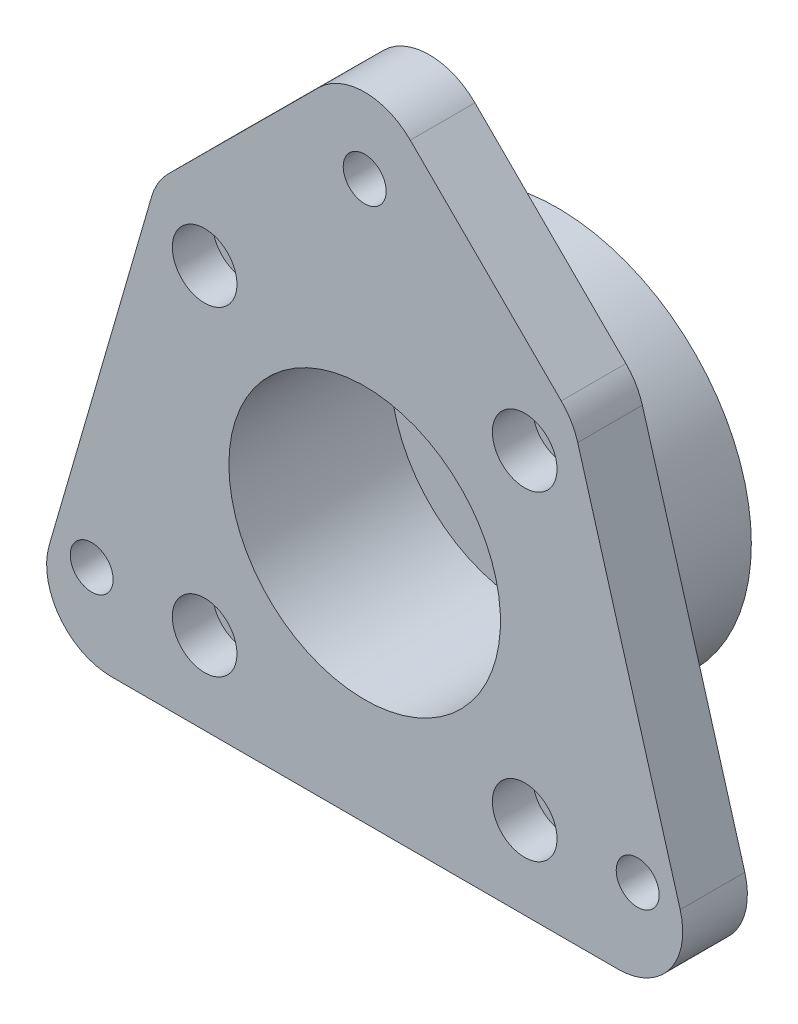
ISO-10303-21;
HEADER;
FILE_DESCRIPTION(('STEP AP214'),'2;1');
FILE_NAME('part.step','',(''),(''),'','','');
FILE_SCHEMA(('AUTOMOTIVE_DESIGN { 1 0 10303 214 1 1 1 1 }'));
ENDSEC;
DATA;
#1=APPLICATION_CONTEXT('core data for automotive mechanical design processes');
#2=APPLICATION_PROTOCOL_DEFINITION('international standard','automotive_design',2000,#1);
#3=PRODUCT_CONTEXT('',#1,'mechanical');
#4=PRODUCT('Part','Part','',(#3));
#5=PRODUCT_RELATED_PRODUCT_CATEGORY('part','',(#4));
#6=PRODUCT_DEFINITION_FORMATION('','',#4);
#7=PRODUCT_DEFINITION_CONTEXT('part definition',#1,'design');
#8=PRODUCT_DEFINITION('design','',#6,#7);
#9=PRODUCT_DEFINITION_SHAPE('','',#8);
#10=(LENGTH_UNIT() NAMED_UNIT(*) SI_UNIT(.MILLI.,.METRE.));
#11=(NAMED_UNIT(*) PLANE_ANGLE_UNIT() SI_UNIT($,.RADIAN.));
#12=(NAMED_UNIT(*) SI_UNIT($,.STERADIAN.) SOLID_ANGLE_UNIT());
#13=UNCERTAINTY_MEASURE_WITH_UNIT(LENGTH_MEASURE(1.E-05),#10,'distance_accuracy_value','');
#14=(GEOMETRIC_REPRESENTATION_CONTEXT(3) GLOBAL_UNCERTAINTY_ASSIGNED_CONTEXT((#13)) GLOBAL_UNIT_ASSIGNED_CONTEXT((#10,
#11,#12)) REPRESENTATION_CONTEXT('',''));
#15=CARTESIAN_POINT('',(0.,0.,0.));
#16=DIRECTION('',(0.,0.,1.));
#17=DIRECTION('',(1.,0.,0.));
#18=AXIS2_PLACEMENT_3D('',#15,#16,#17);
#19=CARTESIAN_POINT('',(0.,0.,-25.2306666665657));
#20=DIRECTION('',(0.,0.,1.));
#21=DIRECTION('',(1.,0.,0.));
#22=AXIS2_PLACEMENT_3D('',#19,#20,#21);
#23=PLANE('',#22);
#24=CARTESIAN_POINT('',(0.,0.,-25.2306666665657));
#25=DIRECTION('',(0.,0.,1.));
#26=DIRECTION('',(1.,0.,0.));
#27=AXIS2_PLACEMENT_3D('',#24,#25,#26);
#28=CIRCLE('',#27,25.4);
#29=CARTESIAN_POINT('',(25.4,0.,-25.2306666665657));
#30=VERTEX_POINT('',#29);
#31=EDGE_CURVE('E19',#30,#30,#28,.T.);
#32=ORIENTED_EDGE('',*,*,#31,.F.);
#33=EDGE_LOOP('',(#32));
#34=FACE_BOUND('',#33,.T.);
#35=ADVANCED_FACE('F16',(#34),#23,.F.);
#36=CARTESIAN_POINT('',(0.,0.,-26.492199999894));
#37=DIRECTION('',(0.,0.,1.));
#38=DIRECTION('',(1.,0.,0.));
#39=AXIS2_PLACEMENT_3D('',#36,#37,#38);
#40=CYLINDRICAL_SURFACE('',#39,25.4);
#41=ORIENTED_EDGE('',*,*,#31,.T.);
#42=EDGE_LOOP('',(#41));
#43=FACE_BOUND('',#42,.T.);
#44=CARTESIAN_POINT('',(0.,0.,-8.4666666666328));
#45=DIRECTION('',(0.,0.,1.));
#46=DIRECTION('',(1.,0.,0.));
#47=AXIS2_PLACEMENT_3D('',#44,#45,#46);
#48=CIRCLE('',#47,25.4);
#49=CARTESIAN_POINT('',(25.4,0.,-8.4666666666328));
#50=VERTEX_POINT('',#49);
#51=EDGE_CURVE('E215',#50,#50,#48,.T.);
#52=ORIENTED_EDGE('',*,*,#51,.F.);
#53=EDGE_LOOP('',(#52));
#54=FACE_BOUND('',#53,.T.);
#55=ADVANCED_FACE('F233',(#43,#54),#40,.T.);
#56=CARTESIAN_POINT('',(20.9545296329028,-20.9545296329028,2.52306666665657));
#57=DIRECTION('',(0.,0.,-1.));
#58=DIRECTION('',(-1.,0.,0.));
#59=AXIS2_PLACEMENT_3D('',#56,#57,#58);
#60=CYLINDRICAL_SURFACE('',#59,2.81093333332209);
#61=CARTESIAN_POINT('',(20.9545296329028,-20.9545296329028,-8.4666666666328));
#62=DIRECTION('',(0.,0.,-1.));
#63=DIRECTION('',(-1.,0.,0.));
#64=AXIS2_PLACEMENT_3D('',#61,#62,#63);
#65=CIRCLE('',#64,2.81093333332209);
#66=CARTESIAN_POINT('',(18.1435962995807,-20.9545296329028,-8.4666666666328));
#67=VERTEX_POINT('',#66);
#68=EDGE_CURVE('E212',#67,#67,#65,.F.);
#69=ORIENTED_EDGE('',*,*,#68,.F.);
#70=EDGE_LOOP('',(#69));
#71=FACE_BOUND('',#70,.T.);
#72=CARTESIAN_POINT('',(20.9545296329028,-20.9545296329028,-5.28319999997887));
#73=DIRECTION('',(0.,0.,-1.));
#74=DIRECTION('',(-1.,0.,0.));
#75=AXIS2_PLACEMENT_3D('',#72,#73,#74);
#76=CIRCLE('',#75,2.81093333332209);
#77=CARTESIAN_POINT('',(18.1435962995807,-20.9545296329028,-5.28319999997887));
#78=VERTEX_POINT('',#77);
#79=EDGE_CURVE('E226',#78,#78,#76,.F.);
#80=ORIENTED_EDGE('',*,*,#79,.T.);
#81=EDGE_LOOP('',(#80));
#82=FACE_BOUND('',#81,.T.);
#83=ADVANCED_FACE('F241',(#71,#82),#60,.F.);
#84=CARTESIAN_POINT('',(20.9545296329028,20.9545296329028,2.52306666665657));
#85=DIRECTION('',(0.,0.,-1.));
#86=DIRECTION('',(-1.,0.,0.));
#87=AXIS2_PLACEMENT_3D('',#84,#85,#86);
#88=CYLINDRICAL_SURFACE('',#87,2.81093333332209);
#89=CARTESIAN_POINT('',(20.9545296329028,20.9545296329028,-8.4666666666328));
#90=DIRECTION('',(0.,0.,-1.));
#91=DIRECTION('',(-1.,0.,0.));
#92=AXIS2_PLACEMENT_3D('',#89,#90,#91);
#93=CIRCLE('',#92,2.81093333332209);
#94=CARTESIAN_POINT('',(18.1435962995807,20.9545296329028,-8.4666666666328));
#95=VERTEX_POINT('',#94);
#96=EDGE_CURVE('E209',#95,#95,#93,.F.);
#97=ORIENTED_EDGE('',*,*,#96,.F.);
#98=EDGE_LOOP('',(#97));
#99=FACE_BOUND('',#98,.T.);
#100=CARTESIAN_POINT('',(20.9545296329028,20.9545296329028,-5.28319999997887));
#101=DIRECTION('',(0.,0.,-1.));
#102=DIRECTION('',(-1.,0.,0.));
#103=AXIS2_PLACEMENT_3D('',#100,#101,#102);
#104=CIRCLE('',#103,2.81093333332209);
#105=CARTESIAN_POINT('',(18.1435962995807,20.9545296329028,-5.28319999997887));
#106=VERTEX_POINT('',#105);
#107=EDGE_CURVE('E224',#106,#106,#104,.F.);
#108=ORIENTED_EDGE('',*,*,#107,.T.);
#109=EDGE_LOOP('',(#108));
#110=FACE_BOUND('',#109,.T.);
#111=ADVANCED_FACE('F347',(#99,#110),#88,.F.);
#112=CARTESIAN_POINT('',(-20.9545296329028,20.9545296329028,2.52306666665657));
#113=DIRECTION('',(0.,0.,-1.));
#114=DIRECTION('',(-1.,0.,0.));
#115=AXIS2_PLACEMENT_3D('',#112,#113,#114);
#116=CYLINDRICAL_SURFACE('',#115,2.81093333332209);
#117=CARTESIAN_POINT('',(-20.9545296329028,20.9545296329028,-8.4666666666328));
#118=DIRECTION('',(0.,0.,-1.));
#119=DIRECTION('',(-1.,0.,0.));
#120=AXIS2_PLACEMENT_3D('',#117,#118,#119);
#121=CIRCLE('',#120,2.81093333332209);
#122=CARTESIAN_POINT('',(-23.7654629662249,20.9545296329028,-8.4666666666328));
#123=VERTEX_POINT('',#122);
#124=EDGE_CURVE('E206',#123,#123,#121,.F.);
#125=ORIENTED_EDGE('',*,*,#124,.F.);
#126=EDGE_LOOP('',(#125));
#127=FACE_BOUND('',#126,.T.);
#128=CARTESIAN_POINT('',(-20.9545296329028,20.9545296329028,-5.28319999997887));
#129=DIRECTION('',(0.,0.,-1.));
#130=DIRECTION('',(-1.,0.,0.));
#131=AXIS2_PLACEMENT_3D('',#128,#129,#130);
#132=CIRCLE('',#131,2.81093333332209);
#133=CARTESIAN_POINT('',(-23.7654629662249,20.9545296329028,-5.28319999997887));
#134=VERTEX_POINT('',#133);
#135=EDGE_CURVE('E221',#134,#134,#132,.F.);
#136=ORIENTED_EDGE('',*,*,#135,.T.);
#137=EDGE_LOOP('',(#136));
#138=FACE_BOUND('',#137,.T.);
#139=ADVANCED_FACE('F343',(#127,#138),#116,.F.);
#140=CARTESIAN_POINT('',(-20.9545296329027,-20.9545296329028,2.52306666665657));
#141=DIRECTION('',(0.,0.,-1.));
#142=DIRECTION('',(-1.,0.,0.));
#143=AXIS2_PLACEMENT_3D('',#140,#141,#142);
#144=CYLINDRICAL_SURFACE('',#143,2.81093333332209);
#145=CARTESIAN_POINT('',(-20.9545296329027,-20.9545296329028,-8.4666666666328));
#146=DIRECTION('',(0.,0.,-1.));
#147=DIRECTION('',(-1.,0.,0.));
#148=AXIS2_PLACEMENT_3D('',#145,#146,#147);
#149=CIRCLE('',#148,2.81093333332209);
#150=CARTESIAN_POINT('',(-23.7654629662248,-20.9545296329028,-8.4666666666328));
#151=VERTEX_POINT('',#150);
#152=EDGE_CURVE('E113',#151,#151,#149,.F.);
#153=ORIENTED_EDGE('',*,*,#152,.F.);
#154=EDGE_LOOP('',(#153));
#155=FACE_BOUND('',#154,.T.);
#156=CARTESIAN_POINT('',(-20.9545296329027,-20.9545296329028,-5.28319999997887));
#157=DIRECTION('',(0.,0.,-1.));
#158=DIRECTION('',(-1.,0.,0.));
#159=AXIS2_PLACEMENT_3D('',#156,#157,#158);
#160=CIRCLE('',#159,2.81093333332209);
#161=CARTESIAN_POINT('',(-23.7654629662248,-20.9545296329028,-5.28319999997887));
#162=VERTEX_POINT('',#161);
#163=EDGE_CURVE('E218',#162,#162,#160,.F.);
#164=ORIENTED_EDGE('',*,*,#163,.T.);
#165=EDGE_LOOP('',(#164));
#166=FACE_BOUND('',#165,.T.);
#167=ADVANCED_FACE('F339',(#155,#166),#144,.F.);
#168=CARTESIAN_POINT('',(0.,0.,-21.166666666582));
#169=DIRECTION('',(0.,0.,-1.));
#170=DIRECTION('',(-1.,0.,0.));
#171=AXIS2_PLACEMENT_3D('',#168,#169,#170);
#172=PLANE('',#171);
#173=CARTESIAN_POINT('',(0.,0.,-21.166666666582));
#174=DIRECTION('',(0.,0.,-1.));
#175=DIRECTION('',(-1.,0.,0.));
#176=AXIS2_PLACEMENT_3D('',#173,#174,#175);
#177=CIRCLE('',#176,17.78);
#178=CARTESIAN_POINT('',(-17.78,0.,-21.166666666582));
#179=VERTEX_POINT('',#178);
#180=EDGE_CURVE('E193',#179,#179,#177,.F.);
#181=ORIENTED_EDGE('',*,*,#180,.T.);
#182=EDGE_LOOP('',(#181));
#183=FACE_BOUND('',#182,.T.);
#184=ADVANCED_FACE('F335',(#183),#172,.F.);
#185=CARTESIAN_POINT('',(20.9545296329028,-20.9545296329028,-5.28319999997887));
#186=DIRECTION('',(0.,0.,-1.));
#187=DIRECTION('',(-1.,0.,0.));
#188=AXIS2_PLACEMENT_3D('',#185,#186,#187);
#189=PLANE('',#188);
#190=ORIENTED_EDGE('',*,*,#79,.F.);
#191=EDGE_LOOP('',(#190));
#192=FACE_BOUND('',#191,.T.);
#193=CARTESIAN_POINT('',(20.9545296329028,-20.9545296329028,-5.28319999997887));
#194=DIRECTION('',(0.,0.,-1.));
#195=DIRECTION('',(-1.,0.,0.));
#196=AXIS2_PLACEMENT_3D('',#193,#194,#195);
#197=CIRCLE('',#196,4.2333333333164);
#198=CARTESIAN_POINT('',(16.7211962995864,-20.9545296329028,-5.28319999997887));
#199=VERTEX_POINT('',#198);
#200=EDGE_CURVE('E190',#199,#199,#197,.F.);
#201=ORIENTED_EDGE('',*,*,#200,.T.);
#202=EDGE_LOOP('',(#201));
#203=FACE_BOUND('',#202,.T.);
#204=ADVANCED_FACE('F331',(#192,#203),#189,.F.);
#205=CARTESIAN_POINT('',(20.9545296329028,20.9545296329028,-5.28319999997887));
#206=DIRECTION('',(0.,0.,-1.));
#207=DIRECTION('',(-1.,0.,0.));
#208=AXIS2_PLACEMENT_3D('',#205,#206,#207);
#209=PLANE('',#208);
#210=ORIENTED_EDGE('',*,*,#107,.F.);
#211=EDGE_LOOP('',(#210));
#212=FACE_BOUND('',#211,.T.);
#213=CARTESIAN_POINT('',(20.9545296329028,20.9545296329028,-5.28319999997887));
#214=DIRECTION('',(0.,0.,-1.));
#215=DIRECTION('',(-1.,0.,0.));
#216=AXIS2_PLACEMENT_3D('',#213,#214,#215);
#217=CIRCLE('',#216,4.2333333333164);
#218=CARTESIAN_POINT('',(16.7211962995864,20.9545296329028,-5.28319999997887));
#219=VERTEX_POINT('',#218);
#220=EDGE_CURVE('E187',#219,#219,#217,.F.);
#221=ORIENTED_EDGE('',*,*,#220,.T.);
#222=EDGE_LOOP('',(#221));
#223=FACE_BOUND('',#222,.T.);
#224=ADVANCED_FACE('F327',(#212,#223),#209,.F.);
#225=CARTESIAN_POINT('',(-20.9545296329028,20.9545296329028,-5.28319999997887));
#226=DIRECTION('',(0.,0.,-1.));
#227=DIRECTION('',(-1.,0.,0.));
#228=AXIS2_PLACEMENT_3D('',#225,#226,#227);
#229=PLANE('',#228);
#230=ORIENTED_EDGE('',*,*,#135,.F.);
#231=EDGE_LOOP('',(#230));
#232=FACE_BOUND('',#231,.T.);
#233=CARTESIAN_POINT('',(-20.9545296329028,20.9545296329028,-5.28319999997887));
#234=DIRECTION('',(0.,0.,-1.));
#235=DIRECTION('',(-1.,0.,0.));
#236=AXIS2_PLACEMENT_3D('',#233,#234,#235);
#237=CIRCLE('',#236,4.2333333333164);
#238=CARTESIAN_POINT('',(-25.1878629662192,20.9545296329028,-5.28319999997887));
#239=VERTEX_POINT('',#238);
#240=EDGE_CURVE('E184',#239,#239,#237,.F.);
#241=ORIENTED_EDGE('',*,*,#240,.T.);
#242=EDGE_LOOP('',(#241));
#243=FACE_BOUND('',#242,.T.);
#244=ADVANCED_FACE('F323',(#232,#243),#229,.F.);
#245=CARTESIAN_POINT('',(-20.9545296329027,-20.9545296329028,-5.28319999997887));
#246=DIRECTION('',(0.,0.,-1.));
#247=DIRECTION('',(-1.,0.,0.));
#248=AXIS2_PLACEMENT_3D('',#245,#246,#247);
#249=PLANE('',#248);
#250=ORIENTED_EDGE('',*,*,#163,.F.);
#251=EDGE_LOOP('',(#250));
#252=FACE_BOUND('',#251,.T.);
#253=CARTESIAN_POINT('',(-20.9545296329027,-20.9545296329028,-5.28319999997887));
#254=DIRECTION('',(0.,0.,-1.));
#255=DIRECTION('',(-1.,0.,0.));
#256=AXIS2_PLACEMENT_3D('',#253,#254,#255);
#257=CIRCLE('',#256,4.2333333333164);
#258=CARTESIAN_POINT('',(-25.1878629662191,-20.9545296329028,-5.28319999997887));
#259=VERTEX_POINT('',#258);
#260=EDGE_CURVE('E181',#259,#259,#257,.F.);
#261=ORIENTED_EDGE('',*,*,#260,.T.);
#262=EDGE_LOOP('',(#261));
#263=FACE_BOUND('',#262,.T.);
#264=ADVANCED_FACE('F319',(#252,#263),#249,.F.);
#265=CARTESIAN_POINT('',(0.,0.,-8.4666666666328));
#266=DIRECTION('',(0.,0.,-1.));
#267=DIRECTION('',(-1.,0.,0.));
#268=AXIS2_PLACEMENT_3D('',#265,#266,#267);
#269=PLANE('',#268);
#270=CARTESIAN_POINT('',(-35.7458584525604,-20.637881,-8.4666666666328));
#271=DIRECTION('',(0.,0.,1.));
#272=DIRECTION('',(1.,0.,0.));
#273=AXIS2_PLACEMENT_3D('',#270,#271,#272);
#274=CIRCLE('',#273,2.81093333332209);
#275=CARTESIAN_POINT('',(-32.9349251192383,-20.637881,-8.4666666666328));
#276=VERTEX_POINT('',#275);
#277=EDGE_CURVE('E172',#276,#276,#274,.T.);
#278=ORIENTED_EDGE('',*,*,#277,.T.);
#279=EDGE_LOOP('',(#278));
#280=FACE_BOUND('',#279,.T.);
#281=CARTESIAN_POINT('',(35.7458584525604,-20.637881,-8.4666666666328));
#282=DIRECTION('',(0.,0.,-1.));
#283=DIRECTION('',(-1.,0.,0.));
#284=AXIS2_PLACEMENT_3D('',#281,#282,#283);
#285=CIRCLE('',#284,2.81093333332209);
#286=CARTESIAN_POINT('',(32.9349251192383,-20.637881,-8.4666666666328));
#287=VERTEX_POINT('',#286);
#288=EDGE_CURVE('E175',#287,#287,#285,.F.);
#289=ORIENTED_EDGE('',*,*,#288,.T.);
#290=EDGE_LOOP('',(#289));
#291=FACE_BOUND('',#290,.T.);
#292=CARTESIAN_POINT('',(0.,41.275,-8.4666666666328));
#293=DIRECTION('',(0.,0.,-1.));
#294=DIRECTION('',(-1.,0.,0.));
#295=AXIS2_PLACEMENT_3D('',#292,#293,#294);
#296=CIRCLE('',#295,2.81093333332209);
#297=CARTESIAN_POINT('',(-2.81093333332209,41.275,-8.4666666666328));
#298=VERTEX_POINT('',#297);
#299=EDGE_CURVE('E178',#298,#298,#296,.F.);
#300=ORIENTED_EDGE('',*,*,#299,.T.);
#301=EDGE_LOOP('',(#300));
#302=FACE_BOUND('',#301,.T.);
#303=ORIENTED_EDGE('',*,*,#152,.T.);
#304=EDGE_LOOP('',(#303));
#305=FACE_BOUND('',#304,.T.);
#306=ORIENTED_EDGE('',*,*,#124,.T.);
#307=EDGE_LOOP('',(#306));
#308=FACE_BOUND('',#307,.T.);
#309=ORIENTED_EDGE('',*,*,#96,.T.);
#310=EDGE_LOOP('',(#309));
#311=FACE_BOUND('',#310,.T.);
#312=ORIENTED_EDGE('',*,*,#68,.T.);
#313=EDGE_LOOP('',(#312));
#314=FACE_BOUND('',#313,.T.);
#315=ORIENTED_EDGE('',*,*,#51,.T.);
#316=EDGE_LOOP('',(#315));
#317=FACE_BOUND('',#316,.T.);
#318=CARTESIAN_POINT('',(-19.7634977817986,22.9758746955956,-8.4666666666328));
#319=DIRECTION('',(0.,0.,1.));
#320=DIRECTION('',(1.,0.,0.));
#321=AXIS2_PLACEMENT_3D('',#318,#319,#320);
#322=CIRCLE('',#321,8.4666666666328);
#323=CARTESIAN_POINT('',(-25.7383173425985,28.9747058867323,-8.4666666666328));
#324=VERTEX_POINT('',#323);
#325=CARTESIAN_POINT('',(-27.8950832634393,25.3342135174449,-8.4666666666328));
#326=VERTEX_POINT('',#325);
#327=EDGE_CURVE('E109',#324,#326,#322,.T.);
#328=ORIENTED_EDGE('',*,*,#327,.F.);
#329=DIRECTION('',(-0.708523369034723,-0.705687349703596,0.));
#330=VECTOR('',#329,1.);
#331=CARTESIAN_POINT('',(-27.286458,27.432762,-8.4666666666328));
#332=LINE('',#331,#330);
#333=CARTESIAN_POINT('',(-5.97481956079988,48.6590959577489,-8.4666666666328));
#334=VERTEX_POINT('',#333);
#335=EDGE_CURVE('E104',#334,#324,#332,.T.);
#336=ORIENTED_EDGE('',*,*,#335,.F.);
#337=CARTESIAN_POINT('',(0.,42.6602647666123,-8.4666666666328));
#338=DIRECTION('',(0.,0.,1.));
#339=DIRECTION('',(1.,0.,0.));
#340=AXIS2_PLACEMENT_3D('',#337,#338,#339);
#341=CIRCLE('',#340,8.4666666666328);
#342=CARTESIAN_POINT('',(5.97481956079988,48.6590959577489,-8.4666666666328));
#343=VERTEX_POINT('',#342);
#344=EDGE_CURVE('E95',#343,#334,#341,.T.);
#345=ORIENTED_EDGE('',*,*,#344,.F.);
#346=DIRECTION('',(-0.708523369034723,0.705687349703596,0.));
#347=VECTOR('',#346,1.);
#348=CARTESIAN_POINT('',(0.,54.61,-8.4666666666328));
#349=LINE('',#348,#347);
#350=CARTESIAN_POINT('',(25.7383173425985,28.9747058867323,-8.4666666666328));
#351=VERTEX_POINT('',#350);
#352=EDGE_CURVE('E90',#351,#343,#349,.T.);
#353=ORIENTED_EDGE('',*,*,#352,.F.);
#354=CARTESIAN_POINT('',(19.7634977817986,22.9758746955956,-8.4666666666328));
#355=DIRECTION('',(0.,0.,1.));
#356=DIRECTION('',(1.,0.,0.));
#357=AXIS2_PLACEMENT_3D('',#354,#355,#356);
#358=CIRCLE('',#357,8.4666666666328);
#359=CARTESIAN_POINT('',(27.8950832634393,25.3342135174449,-8.4666666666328));
#360=VERTEX_POINT('',#359);
#361=EDGE_CURVE('E202',#360,#351,#358,.T.);
#362=ORIENTED_EDGE('',*,*,#361,.F.);
#363=DIRECTION('',(-0.278543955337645,0.960423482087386,0.));
#364=VECTOR('',#363,1.);
#365=CARTESIAN_POINT('',(27.286458,27.432762,-8.4666666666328));
#366=LINE('',#365,#364);
#367=CARTESIAN_POINT('',(41.3112720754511,-20.9249945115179,-8.4666666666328));
#368=VERTEX_POINT('',#367);
#369=EDGE_CURVE('E131',#368,#360,#366,.T.);
#370=ORIENTED_EDGE('',*,*,#369,.F.);
#371=CARTESIAN_POINT('',(33.1796865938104,-23.2833333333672,-8.4666666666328));
#372=DIRECTION('',(0.,0.,1.));
#373=DIRECTION('',(1.,0.,0.));
#374=AXIS2_PLACEMENT_3D('',#371,#372,#373);
#375=CIRCLE('',#374,8.4666666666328);
#376=CARTESIAN_POINT('',(33.1796865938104,-31.75,-8.4666666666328));
#377=VERTEX_POINT('',#376);
#378=EDGE_CURVE('E200',#377,#368,#375,.T.);
#379=ORIENTED_EDGE('',*,*,#378,.F.);
#380=DIRECTION('',(1.,0.,0.));
#381=VECTOR('',#380,1.);
#382=CARTESIAN_POINT('',(44.450762,-31.75,-8.4666666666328));
#383=LINE('',#382,#381);
#384=CARTESIAN_POINT('',(-33.1796865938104,-31.75,-8.4666666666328));
#385=VERTEX_POINT('',#384);
#386=EDGE_CURVE('E127',#385,#377,#383,.T.);
#387=ORIENTED_EDGE('',*,*,#386,.F.);
#388=CARTESIAN_POINT('',(-33.1796865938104,-23.2833333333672,-8.4666666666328));
#389=DIRECTION('',(0.,0.,1.));
#390=DIRECTION('',(1.,0.,0.));
#391=AXIS2_PLACEMENT_3D('',#388,#389,#390);
#392=CIRCLE('',#391,8.4666666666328);
#393=CARTESIAN_POINT('',(-41.3112720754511,-20.9249945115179,-8.4666666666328));
#394=VERTEX_POINT('',#393);
#395=EDGE_CURVE('E198',#394,#385,#392,.T.);
#396=ORIENTED_EDGE('',*,*,#395,.F.);
#397=DIRECTION('',(-0.278543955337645,-0.960423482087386,0.));
#398=VECTOR('',#397,1.);
#399=CARTESIAN_POINT('',(-44.450762,-31.75,-8.4666666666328));
#400=LINE('',#399,#398);
#401=EDGE_CURVE('E123',#326,#394,#400,.T.);
#402=ORIENTED_EDGE('',*,*,#401,.F.);
#403=EDGE_LOOP('',(#328,#336,#345,#353,#362,#370,#379,#387,#396,#402));
#404=FACE_BOUND('',#403,.T.);
#405=ADVANCED_FACE('F107',(#280,#291,#302,#305,#308,#311,#314,#317,#404),#269,.T.);
#406=CARTESIAN_POINT('',(-27.286458,27.432762,0.));
#407=DIRECTION('',(-0.705687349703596,0.708523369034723,0.));
#408=DIRECTION('',(-0.708523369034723,-0.705687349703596,0.));
#409=AXIS2_PLACEMENT_3D('',#406,#407,#408);
#410=PLANE('',#409);
#411=DIRECTION('',(0.,0.,1.));
#412=VECTOR('',#411,1.);
#413=CARTESIAN_POINT('',(-25.7383173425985,28.9747058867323,0.));
#414=LINE('',#413,#412);
#415=CARTESIAN_POINT('',(-25.7383173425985,28.9747058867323,0.));
#416=VERTEX_POINT('',#415);
#417=EDGE_CURVE('E196',#416,#324,#414,.F.);
#418=ORIENTED_EDGE('',*,*,#417,.F.);
#419=DIRECTION('',(0.708523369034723,0.705687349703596,0.));
#420=VECTOR('',#419,1.);
#421=CARTESIAN_POINT('',(-25.7383173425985,28.9747058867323,0.));
#422=LINE('',#421,#420);
#423=CARTESIAN_POINT('',(-5.97481956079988,48.6590959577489,0.));
#424=VERTEX_POINT('',#423);
#425=EDGE_CURVE('E117',#416,#424,#422,.T.);
#426=ORIENTED_EDGE('',*,*,#425,.T.);
#427=DIRECTION('',(0.,0.,1.));
#428=VECTOR('',#427,1.);
#429=CARTESIAN_POINT('',(-5.97481956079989,48.6590959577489,0.));
#430=LINE('',#429,#428);
#431=EDGE_CURVE('E100',#334,#424,#430,.T.);
#432=ORIENTED_EDGE('',*,*,#431,.F.);
#433=ORIENTED_EDGE('',*,*,#335,.T.);
#434=EDGE_LOOP('',(#418,#426,#432,#433));
#435=FACE_BOUND('',#434,.T.);
#436=ADVANCED_FACE('F116',(#435),#410,.T.);
#437=CARTESIAN_POINT('',(0.,42.6602647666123,0.));
#438=DIRECTION('',(0.,0.,1.));
#439=DIRECTION('',(1.,0.,0.));
#440=AXIS2_PLACEMENT_3D('',#437,#438,#439);
#441=CYLINDRICAL_SURFACE('',#440,8.4666666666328);
#442=CARTESIAN_POINT('',(0.,42.6602647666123,0.));
#443=DIRECTION('',(0.,0.,1.));
#444=DIRECTION('',(1.,0.,0.));
#445=AXIS2_PLACEMENT_3D('',#442,#443,#444);
#446=CIRCLE('',#445,8.4666666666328);
#447=CARTESIAN_POINT('',(5.97481956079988,48.6590959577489,0.));
#448=VERTEX_POINT('',#447);
#449=EDGE_CURVE('E170',#424,#448,#446,.F.);
#450=ORIENTED_EDGE('',*,*,#449,.T.);
#451=DIRECTION('',(0.,0.,1.));
#452=VECTOR('',#451,1.);
#453=CARTESIAN_POINT('',(5.97481956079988,48.6590959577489,0.));
#454=LINE('',#453,#452);
#455=EDGE_CURVE('E102',#343,#448,#454,.T.);
#456=ORIENTED_EDGE('',*,*,#455,.F.);
#457=ORIENTED_EDGE('',*,*,#344,.T.);
#458=ORIENTED_EDGE('',*,*,#431,.T.);
#459=EDGE_LOOP('',(#450,#456,#457,#458));
#460=FACE_BOUND('',#459,.T.);
#461=ADVANCED_FACE('F98',(#460),#441,.T.);
#462=CARTESIAN_POINT('',(0.,54.61,0.));
#463=DIRECTION('',(0.705687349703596,0.708523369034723,0.));
#464=DIRECTION('',(-0.708523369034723,0.705687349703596,0.));
#465=AXIS2_PLACEMENT_3D('',#462,#463,#464);
#466=PLANE('',#465);
#467=ORIENTED_EDGE('',*,*,#455,.T.);
#468=DIRECTION('',(0.708523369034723,-0.705687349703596,0.));
#469=VECTOR('',#468,1.);
#470=CARTESIAN_POINT('',(5.97481956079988,48.6590959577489,0.));
#471=LINE('',#470,#469);
#472=CARTESIAN_POINT('',(25.7383173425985,28.9747058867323,0.));
#473=VERTEX_POINT('',#472);
#474=EDGE_CURVE('E169',#448,#473,#471,.T.);
#475=ORIENTED_EDGE('',*,*,#474,.T.);
#476=DIRECTION('',(0.,0.,1.));
#477=VECTOR('',#476,1.);
#478=CARTESIAN_POINT('',(25.7383173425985,28.9747058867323,0.));
#479=LINE('',#478,#477);
#480=EDGE_CURVE('E133',#351,#473,#479,.T.);
#481=ORIENTED_EDGE('',*,*,#480,.F.);
#482=ORIENTED_EDGE('',*,*,#352,.T.);
#483=EDGE_LOOP('',(#467,#475,#481,#482));
#484=FACE_BOUND('',#483,.T.);
#485=ADVANCED_FACE('F309',(#484),#466,.T.);
#486=CARTESIAN_POINT('',(19.7634977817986,22.9758746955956,0.));
#487=DIRECTION('',(0.,0.,1.));
#488=DIRECTION('',(1.,0.,0.));
#489=AXIS2_PLACEMENT_3D('',#486,#487,#488);
#490=CYLINDRICAL_SURFACE('',#489,8.4666666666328);
#491=CARTESIAN_POINT('',(19.7634977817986,22.9758746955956,0.));
#492=DIRECTION('',(0.,0.,1.));
#493=DIRECTION('',(1.,0.,0.));
#494=AXIS2_PLACEMENT_3D('',#491,#492,#493);
#495=CIRCLE('',#494,8.4666666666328);
#496=CARTESIAN_POINT('',(27.8950832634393,25.3342135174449,0.));
#497=VERTEX_POINT('',#496);
#498=EDGE_CURVE('E166',#473,#497,#495,.F.);
#499=ORIENTED_EDGE('',*,*,#498,.T.);
#500=DIRECTION('',(0.,0.,1.));
#501=VECTOR('',#500,1.);
#502=CARTESIAN_POINT('',(27.8950832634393,25.3342135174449,0.));
#503=LINE('',#502,#501);
#504=EDGE_CURVE('E132',#360,#497,#503,.T.);
#505=ORIENTED_EDGE('',*,*,#504,.F.);
#506=ORIENTED_EDGE('',*,*,#361,.T.);
#507=ORIENTED_EDGE('',*,*,#480,.T.);
#508=EDGE_LOOP('',(#499,#505,#506,#507));
#509=FACE_BOUND('',#508,.T.);
#510=ADVANCED_FACE('F305',(#509),#490,.T.);
#511=CARTESIAN_POINT('',(27.286458,27.432762,0.));
#512=DIRECTION('',(0.960423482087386,0.278543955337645,0.));
#513=DIRECTION('',(-0.278543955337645,0.960423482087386,0.));
#514=AXIS2_PLACEMENT_3D('',#511,#512,#513);
#515=PLANE('',#514);
#516=ORIENTED_EDGE('',*,*,#504,.T.);
#517=DIRECTION('',(0.278543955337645,-0.960423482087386,0.));
#518=VECTOR('',#517,1.);
#519=CARTESIAN_POINT('',(27.8950832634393,25.3342135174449,0.));
#520=LINE('',#519,#518);
#521=CARTESIAN_POINT('',(41.3112720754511,-20.9249945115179,0.));
#522=VERTEX_POINT('',#521);
#523=EDGE_CURVE('E165',#497,#522,#520,.T.);
#524=ORIENTED_EDGE('',*,*,#523,.T.);
#525=DIRECTION('',(0.,0.,1.));
#526=VECTOR('',#525,1.);
#527=CARTESIAN_POINT('',(41.3112720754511,-20.9249945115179,0.));
#528=LINE('',#527,#526);
#529=EDGE_CURVE('E130',#368,#522,#528,.T.);
#530=ORIENTED_EDGE('',*,*,#529,.F.);
#531=ORIENTED_EDGE('',*,*,#369,.T.);
#532=EDGE_LOOP('',(#516,#524,#530,#531));
#533=FACE_BOUND('',#532,.T.);
#534=ADVANCED_FACE('F301',(#533),#515,.T.);
#535=CARTESIAN_POINT('',(33.1796865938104,-23.2833333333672,0.));
#536=DIRECTION('',(0.,0.,1.));
#537=DIRECTION('',(1.,0.,0.));
#538=AXIS2_PLACEMENT_3D('',#535,#536,#537);
#539=CYLINDRICAL_SURFACE('',#538,8.4666666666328);
#540=CARTESIAN_POINT('',(33.1796865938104,-23.2833333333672,0.));
#541=DIRECTION('',(0.,0.,1.));
#542=DIRECTION('',(1.,0.,0.));
#543=AXIS2_PLACEMENT_3D('',#540,#541,#542);
#544=CIRCLE('',#543,8.4666666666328);
#545=CARTESIAN_POINT('',(33.1796865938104,-31.75,0.));
#546=VERTEX_POINT('',#545);
#547=EDGE_CURVE('E162',#522,#546,#544,.F.);
#548=ORIENTED_EDGE('',*,*,#547,.T.);
#549=DIRECTION('',(0.,0.,-1.));
#550=VECTOR('',#549,1.);
#551=CARTESIAN_POINT('',(33.1796865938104,-31.75,0.));
#552=LINE('',#551,#550);
#553=EDGE_CURVE('E129',#377,#546,#552,.F.);
#554=ORIENTED_EDGE('',*,*,#553,.F.);
#555=ORIENTED_EDGE('',*,*,#378,.T.);
#556=ORIENTED_EDGE('',*,*,#529,.T.);
#557=EDGE_LOOP('',(#548,#554,#555,#556));
#558=FACE_BOUND('',#557,.T.);
#559=ADVANCED_FACE('F297',(#558),#539,.T.);
#560=CARTESIAN_POINT('',(44.450762,-31.75,0.));
#561=DIRECTION('',(0.,-1.,0.));
#562=DIRECTION('',(0.,0.,-1.));
#563=AXIS2_PLACEMENT_3D('',#560,#561,#562);
#564=PLANE('',#563);
#565=ORIENTED_EDGE('',*,*,#553,.T.);
#566=DIRECTION('',(-1.,0.,0.));
#567=VECTOR('',#566,1.);
#568=CARTESIAN_POINT('',(0.,-31.75,0.));
#569=LINE('',#568,#567);
#570=CARTESIAN_POINT('',(-33.1796865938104,-31.75,0.));
#571=VERTEX_POINT('',#570);
#572=EDGE_CURVE('E161',#546,#571,#569,.T.);
#573=ORIENTED_EDGE('',*,*,#572,.T.);
#574=DIRECTION('',(0.,0.,1.));
#575=VECTOR('',#574,1.);
#576=CARTESIAN_POINT('',(-33.1796865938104,-31.75,0.));
#577=LINE('',#576,#575);
#578=EDGE_CURVE('E126',#385,#571,#577,.T.);
#579=ORIENTED_EDGE('',*,*,#578,.F.);
#580=ORIENTED_EDGE('',*,*,#386,.T.);
#581=EDGE_LOOP('',(#565,#573,#579,#580));
#582=FACE_BOUND('',#581,.T.);
#583=ADVANCED_FACE('F293',(#582),#564,.T.);
#584=CARTESIAN_POINT('',(-33.1796865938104,-23.2833333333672,0.));
#585=DIRECTION('',(0.,0.,1.));
#586=DIRECTION('',(1.,0.,0.));
#587=AXIS2_PLACEMENT_3D('',#584,#585,#586);
#588=CYLINDRICAL_SURFACE('',#587,8.4666666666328);
#589=CARTESIAN_POINT('',(-33.1796865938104,-23.2833333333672,0.));
#590=DIRECTION('',(0.,0.,1.));
#591=DIRECTION('',(1.,0.,0.));
#592=AXIS2_PLACEMENT_3D('',#589,#590,#591);
#593=CIRCLE('',#592,8.4666666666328);
#594=CARTESIAN_POINT('',(-41.3112720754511,-20.9249945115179,0.));
#595=VERTEX_POINT('',#594);
#596=EDGE_CURVE('E158',#571,#595,#593,.F.);
#597=ORIENTED_EDGE('',*,*,#596,.T.);
#598=DIRECTION('',(0.,0.,1.));
#599=VECTOR('',#598,1.);
#600=CARTESIAN_POINT('',(-41.3112720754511,-20.9249945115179,0.));
#601=LINE('',#600,#599);
#602=EDGE_CURVE('E125',#394,#595,#601,.T.);
#603=ORIENTED_EDGE('',*,*,#602,.F.);
#604=ORIENTED_EDGE('',*,*,#395,.T.);
#605=ORIENTED_EDGE('',*,*,#578,.T.);
#606=EDGE_LOOP('',(#597,#603,#604,#605));
#607=FACE_BOUND('',#606,.T.);
#608=ADVANCED_FACE('F289',(#607),#588,.T.);
#609=CARTESIAN_POINT('',(-44.450762,-31.75,0.));
#610=DIRECTION('',(-0.960423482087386,0.278543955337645,0.));
#611=DIRECTION('',(-0.278543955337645,-0.960423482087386,0.));
#612=AXIS2_PLACEMENT_3D('',#609,#610,#611);
#613=PLANE('',#612);
#614=ORIENTED_EDGE('',*,*,#602,.T.);
#615=DIRECTION('',(0.278543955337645,0.960423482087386,0.));
#616=VECTOR('',#615,1.);
#617=CARTESIAN_POINT('',(-41.3112720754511,-20.9249945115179,0.));
#618=LINE('',#617,#616);
#619=CARTESIAN_POINT('',(-27.8950832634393,25.3342135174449,0.));
#620=VERTEX_POINT('',#619);
#621=EDGE_CURVE('E157',#595,#620,#618,.T.);
#622=ORIENTED_EDGE('',*,*,#621,.T.);
#623=DIRECTION('',(0.,0.,1.));
#624=VECTOR('',#623,1.);
#625=CARTESIAN_POINT('',(-27.8950832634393,25.3342135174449,0.));
#626=LINE('',#625,#624);
#627=EDGE_CURVE('E34',#326,#620,#626,.T.);
#628=ORIENTED_EDGE('',*,*,#627,.F.);
#629=ORIENTED_EDGE('',*,*,#401,.T.);
#630=EDGE_LOOP('',(#614,#622,#628,#629));
#631=FACE_BOUND('',#630,.T.);
#632=ADVANCED_FACE('F286',(#631),#613,.T.);
#633=CARTESIAN_POINT('',(-19.7634977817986,22.9758746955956,0.));
#634=DIRECTION('',(0.,0.,1.));
#635=DIRECTION('',(1.,0.,0.));
#636=AXIS2_PLACEMENT_3D('',#633,#634,#635);
#637=CYLINDRICAL_SURFACE('',#636,8.4666666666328);
#638=CARTESIAN_POINT('',(-19.7634977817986,22.9758746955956,0.));
#639=DIRECTION('',(0.,0.,1.));
#640=DIRECTION('',(1.,0.,0.));
#641=AXIS2_PLACEMENT_3D('',#638,#639,#640);
#642=CIRCLE('',#641,8.4666666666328);
#643=EDGE_CURVE('E155',#620,#416,#642,.F.);
#644=ORIENTED_EDGE('',*,*,#643,.T.);
#645=ORIENTED_EDGE('',*,*,#417,.T.);
#646=ORIENTED_EDGE('',*,*,#327,.T.);
#647=ORIENTED_EDGE('',*,*,#627,.T.);
#648=EDGE_LOOP('',(#644,#645,#646,#647));
#649=FACE_BOUND('',#648,.T.);
#650=ADVANCED_FACE('F282',(#649),#637,.T.);
#651=CARTESIAN_POINT('',(0.,0.,0.));
#652=DIRECTION('',(0.,0.,-1.));
#653=DIRECTION('',(-1.,0.,0.));
#654=AXIS2_PLACEMENT_3D('',#651,#652,#653);
#655=CYLINDRICAL_SURFACE('',#654,17.78);
#656=ORIENTED_EDGE('',*,*,#180,.F.);
#657=EDGE_LOOP('',(#656));
#658=FACE_BOUND('',#657,.T.);
#659=CARTESIAN_POINT('',(0.,0.,0.));
#660=DIRECTION('',(0.,0.,-1.));
#661=DIRECTION('',(-1.,0.,0.));
#662=AXIS2_PLACEMENT_3D('',#659,#660,#661);
#663=CIRCLE('',#662,17.78);
#664=CARTESIAN_POINT('',(-17.78,0.,0.));
#665=VERTEX_POINT('',#664);
#666=EDGE_CURVE('E152',#665,#665,#663,.F.);
#667=ORIENTED_EDGE('',*,*,#666,.T.);
#668=EDGE_LOOP('',(#667));
#669=FACE_BOUND('',#668,.T.);
#670=ADVANCED_FACE('F278',(#658,#669),#655,.F.);
#671=CARTESIAN_POINT('',(20.9545296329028,-20.9545296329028,0.));
#672=DIRECTION('',(0.,0.,-1.));
#673=DIRECTION('',(-1.,0.,0.));
#674=AXIS2_PLACEMENT_3D('',#671,#672,#673);
#675=CYLINDRICAL_SURFACE('',#674,4.2333333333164);
#676=ORIENTED_EDGE('',*,*,#200,.F.);
#677=EDGE_LOOP('',(#676));
#678=FACE_BOUND('',#677,.T.);
#679=CARTESIAN_POINT('',(20.9545296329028,-20.9545296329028,0.));
#680=DIRECTION('',(0.,0.,-1.));
#681=DIRECTION('',(-1.,0.,0.));
#682=AXIS2_PLACEMENT_3D('',#679,#680,#681);
#683=CIRCLE('',#682,4.2333333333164);
#684=CARTESIAN_POINT('',(16.7211962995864,-20.9545296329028,0.));
#685=VERTEX_POINT('',#684);
#686=EDGE_CURVE('E149',#685,#685,#683,.F.);
#687=ORIENTED_EDGE('',*,*,#686,.T.);
#688=EDGE_LOOP('',(#687));
#689=FACE_BOUND('',#688,.T.);
#690=ADVANCED_FACE('F274',(#678,#689),#675,.F.);
#691=CARTESIAN_POINT('',(20.9545296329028,20.9545296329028,0.));
#692=DIRECTION('',(0.,0.,-1.));
#693=DIRECTION('',(-1.,0.,0.));
#694=AXIS2_PLACEMENT_3D('',#691,#692,#693);
#695=CYLINDRICAL_SURFACE('',#694,4.2333333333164);
#696=ORIENTED_EDGE('',*,*,#220,.F.);
#697=EDGE_LOOP('',(#696));
#698=FACE_BOUND('',#697,.T.);
#699=CARTESIAN_POINT('',(20.9545296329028,20.9545296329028,0.));
#700=DIRECTION('',(0.,0.,-1.));
#701=DIRECTION('',(-1.,0.,0.));
#702=AXIS2_PLACEMENT_3D('',#699,#700,#701);
#703=CIRCLE('',#702,4.2333333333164);
#704=CARTESIAN_POINT('',(16.7211962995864,20.9545296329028,0.));
#705=VERTEX_POINT('',#704);
#706=EDGE_CURVE('E146',#705,#705,#703,.F.);
#707=ORIENTED_EDGE('',*,*,#706,.T.);
#708=EDGE_LOOP('',(#707));
#709=FACE_BOUND('',#708,.T.);
#710=ADVANCED_FACE('F270',(#698,#709),#695,.F.);
#711=CARTESIAN_POINT('',(-20.9545296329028,20.9545296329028,0.));
#712=DIRECTION('',(0.,0.,-1.));
#713=DIRECTION('',(-1.,0.,0.));
#714=AXIS2_PLACEMENT_3D('',#711,#712,#713);
#715=CYLINDRICAL_SURFACE('',#714,4.2333333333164);
#716=ORIENTED_EDGE('',*,*,#240,.F.);
#717=EDGE_LOOP('',(#716));
#718=FACE_BOUND('',#717,.T.);
#719=CARTESIAN_POINT('',(-20.9545296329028,20.9545296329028,0.));
#720=DIRECTION('',(0.,0.,-1.));
#721=DIRECTION('',(-1.,0.,0.));
#722=AXIS2_PLACEMENT_3D('',#719,#720,#721);
#723=CIRCLE('',#722,4.2333333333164);
#724=CARTESIAN_POINT('',(-25.1878629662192,20.9545296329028,0.));
#725=VERTEX_POINT('',#724);
#726=EDGE_CURVE('E143',#725,#725,#723,.F.);
#727=ORIENTED_EDGE('',*,*,#726,.T.);
#728=EDGE_LOOP('',(#727));
#729=FACE_BOUND('',#728,.T.);
#730=ADVANCED_FACE('F266',(#718,#729),#715,.F.);
#731=CARTESIAN_POINT('',(-20.9545296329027,-20.9545296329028,0.));
#732=DIRECTION('',(0.,0.,-1.));
#733=DIRECTION('',(-1.,0.,0.));
#734=AXIS2_PLACEMENT_3D('',#731,#732,#733);
#735=CYLINDRICAL_SURFACE('',#734,4.2333333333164);
#736=ORIENTED_EDGE('',*,*,#260,.F.);
#737=EDGE_LOOP('',(#736));
#738=FACE_BOUND('',#737,.T.);
#739=CARTESIAN_POINT('',(-20.9545296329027,-20.9545296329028,0.));
#740=DIRECTION('',(0.,0.,-1.));
#741=DIRECTION('',(-1.,0.,0.));
#742=AXIS2_PLACEMENT_3D('',#739,#740,#741);
#743=CIRCLE('',#742,4.2333333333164);
#744=CARTESIAN_POINT('',(-25.1878629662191,-20.9545296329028,0.));
#745=VERTEX_POINT('',#744);
#746=EDGE_CURVE('E140',#745,#745,#743,.F.);
#747=ORIENTED_EDGE('',*,*,#746,.T.);
#748=EDGE_LOOP('',(#747));
#749=FACE_BOUND('',#748,.T.);
#750=ADVANCED_FACE('F262',(#738,#749),#735,.F.);
#751=CARTESIAN_POINT('',(0.,41.275,2.52306666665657));
#752=DIRECTION('',(0.,0.,-1.));
#753=DIRECTION('',(-1.,0.,0.));
#754=AXIS2_PLACEMENT_3D('',#751,#752,#753);
#755=CYLINDRICAL_SURFACE('',#754,2.81093333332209);
#756=ORIENTED_EDGE('',*,*,#299,.F.);
#757=EDGE_LOOP('',(#756));
#758=FACE_BOUND('',#757,.T.);
#759=CARTESIAN_POINT('',(0.,41.275,0.));
#760=DIRECTION('',(0.,0.,-1.));
#761=DIRECTION('',(-1.,0.,0.));
#762=AXIS2_PLACEMENT_3D('',#759,#760,#761);
#763=CIRCLE('',#762,2.81093333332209);
#764=CARTESIAN_POINT('',(-2.81093333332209,41.275,0.));
#765=VERTEX_POINT('',#764);
#766=EDGE_CURVE('E137',#765,#765,#763,.F.);
#767=ORIENTED_EDGE('',*,*,#766,.T.);
#768=EDGE_LOOP('',(#767));
#769=FACE_BOUND('',#768,.T.);
#770=ADVANCED_FACE('F258',(#758,#769),#755,.F.);
#771=CARTESIAN_POINT('',(35.7458584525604,-20.637881,2.52306666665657));
#772=DIRECTION('',(0.,0.,-1.));
#773=DIRECTION('',(-1.,0.,0.));
#774=AXIS2_PLACEMENT_3D('',#771,#772,#773);
#775=CYLINDRICAL_SURFACE('',#774,2.81093333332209);
#776=ORIENTED_EDGE('',*,*,#288,.F.);
#777=EDGE_LOOP('',(#776));
#778=FACE_BOUND('',#777,.T.);
#779=CARTESIAN_POINT('',(35.7458584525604,-20.637881,0.));
#780=DIRECTION('',(0.,0.,-1.));
#781=DIRECTION('',(-1.,0.,0.));
#782=AXIS2_PLACEMENT_3D('',#779,#780,#781);
#783=CIRCLE('',#782,2.81093333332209);
#784=CARTESIAN_POINT('',(32.9349251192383,-20.637881,0.));
#785=VERTEX_POINT('',#784);
#786=EDGE_CURVE('E25',#785,#785,#783,.F.);
#787=ORIENTED_EDGE('',*,*,#786,.T.);
#788=EDGE_LOOP('',(#787));
#789=FACE_BOUND('',#788,.T.);
#790=ADVANCED_FACE('F250',(#778,#789),#775,.F.);
#791=CARTESIAN_POINT('',(-35.7458584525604,-20.637881,2.52306666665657));
#792=DIRECTION('',(0.,0.,1.));
#793=DIRECTION('',(1.,0.,0.));
#794=AXIS2_PLACEMENT_3D('',#791,#792,#793);
#795=CYLINDRICAL_SURFACE('',#794,2.81093333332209);
#796=ORIENTED_EDGE('',*,*,#277,.F.);
#797=EDGE_LOOP('',(#796));
#798=FACE_BOUND('',#797,.T.);
#799=CARTESIAN_POINT('',(-35.7458584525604,-20.637881,0.));
#800=DIRECTION('',(0.,0.,1.));
#801=DIRECTION('',(1.,0.,0.));
#802=AXIS2_PLACEMENT_3D('',#799,#800,#801);
#803=CIRCLE('',#802,2.81093333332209);
#804=CARTESIAN_POINT('',(-32.9349251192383,-20.637881,0.));
#805=VERTEX_POINT('',#804);
#806=EDGE_CURVE('E11',#805,#805,#803,.T.);
#807=ORIENTED_EDGE('',*,*,#806,.T.);
#808=EDGE_LOOP('',(#807));
#809=FACE_BOUND('',#808,.T.);
#810=ADVANCED_FACE('F244',(#798,#809),#795,.F.);
#811=CARTESIAN_POINT('',(0.,0.,0.));
#812=DIRECTION('',(0.,0.,-1.));
#813=DIRECTION('',(-1.,0.,0.));
#814=AXIS2_PLACEMENT_3D('',#811,#812,#813);
#815=PLANE('',#814);
#816=ORIENTED_EDGE('',*,*,#806,.F.);
#817=EDGE_LOOP('',(#816));
#818=FACE_BOUND('',#817,.T.);
#819=ORIENTED_EDGE('',*,*,#786,.F.);
#820=EDGE_LOOP('',(#819));
#821=FACE_BOUND('',#820,.T.);
#822=ORIENTED_EDGE('',*,*,#766,.F.);
#823=EDGE_LOOP('',(#822));
#824=FACE_BOUND('',#823,.T.);
#825=ORIENTED_EDGE('',*,*,#746,.F.);
#826=EDGE_LOOP('',(#825));
#827=FACE_BOUND('',#826,.T.);
#828=ORIENTED_EDGE('',*,*,#726,.F.);
#829=EDGE_LOOP('',(#828));
#830=FACE_BOUND('',#829,.T.);
#831=ORIENTED_EDGE('',*,*,#706,.F.);
#832=EDGE_LOOP('',(#831));
#833=FACE_BOUND('',#832,.T.);
#834=ORIENTED_EDGE('',*,*,#686,.F.);
#835=EDGE_LOOP('',(#834));
#836=FACE_BOUND('',#835,.T.);
#837=ORIENTED_EDGE('',*,*,#666,.F.);
#838=EDGE_LOOP('',(#837));
#839=FACE_BOUND('',#838,.T.);
#840=ORIENTED_EDGE('',*,*,#621,.F.);
#841=ORIENTED_EDGE('',*,*,#596,.F.);
#842=ORIENTED_EDGE('',*,*,#572,.F.);
#843=ORIENTED_EDGE('',*,*,#547,.F.);
#844=ORIENTED_EDGE('',*,*,#523,.F.);
#845=ORIENTED_EDGE('',*,*,#498,.F.);
#846=ORIENTED_EDGE('',*,*,#474,.F.);
#847=ORIENTED_EDGE('',*,*,#449,.F.);
#848=ORIENTED_EDGE('',*,*,#425,.F.);
#849=ORIENTED_EDGE('',*,*,#643,.F.);
#850=EDGE_LOOP('',(#840,#841,#842,#843,#844,#845,#846,#847,#848,#849));
#851=FACE_BOUND('',#850,.T.);
#852=ADVANCED_FACE('F242',(#818,#821,#824,#827,#830,#833,#836,#839,#851),#815,.F.);
#853=CLOSED_SHELL('',(#35,#55,#83,#111,#139,#167,#184,#204,#224,#244,#264,#405,#436,#461,#485,
#510,#534,#559,#583,#608,#632,#650,#670,#690,#710,#730,#750,#770,#790,#810,#852));
#854=MANIFOLD_SOLID_BREP('B1',#853);
#855=ADVANCED_BREP_SHAPE_REPRESENTATION('',(#18,#854),#14);
#856=SHAPE_DEFINITION_REPRESENTATION(#9,#855);
ENDSEC;
END-ISO-10303-21;
